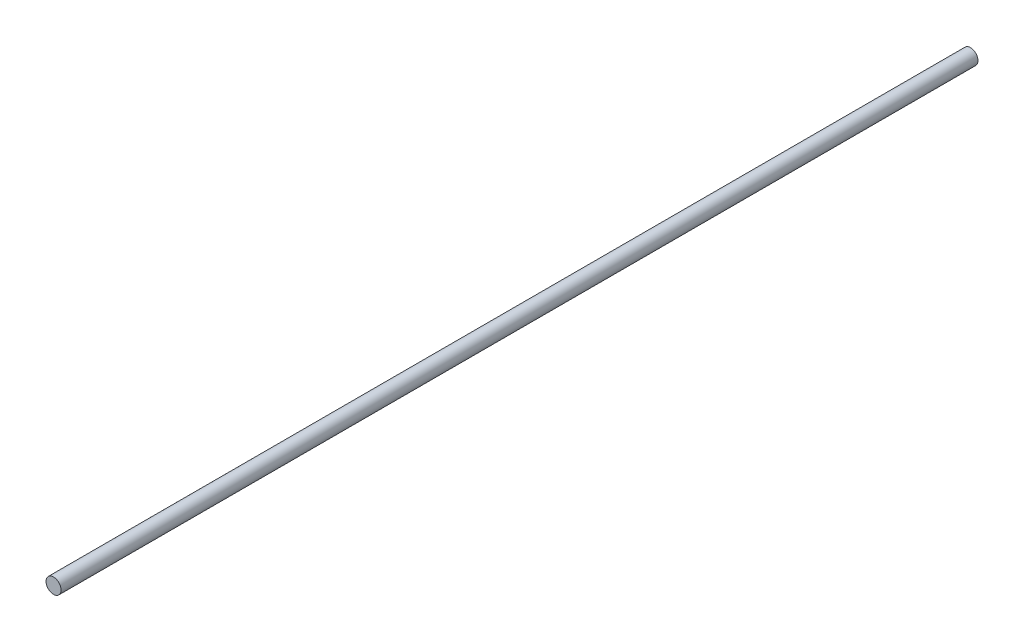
ISO-10303-21;
HEADER;
FILE_DESCRIPTION(('STEP AP214'),'2;1');
FILE_NAME('part.step','',(''),(''),'','','');
FILE_SCHEMA(('AUTOMOTIVE_DESIGN { 1 0 10303 214 1 1 1 1 }'));
ENDSEC;
DATA;
#1=APPLICATION_CONTEXT('core data for automotive mechanical design processes');
#2=APPLICATION_PROTOCOL_DEFINITION('international standard','automotive_design',2000,#1);
#3=PRODUCT_CONTEXT('',#1,'mechanical');
#4=PRODUCT('Part','Part','',(#3));
#5=PRODUCT_RELATED_PRODUCT_CATEGORY('part','',(#4));
#6=PRODUCT_DEFINITION_FORMATION('','',#4);
#7=PRODUCT_DEFINITION_CONTEXT('part definition',#1,'design');
#8=PRODUCT_DEFINITION('design','',#6,#7);
#9=PRODUCT_DEFINITION_SHAPE('','',#8);
#10=(LENGTH_UNIT() NAMED_UNIT(*) SI_UNIT(.MILLI.,.METRE.));
#11=(NAMED_UNIT(*) PLANE_ANGLE_UNIT() SI_UNIT($,.RADIAN.));
#12=(NAMED_UNIT(*) SI_UNIT($,.STERADIAN.) SOLID_ANGLE_UNIT());
#13=UNCERTAINTY_MEASURE_WITH_UNIT(LENGTH_MEASURE(1.E-05),#10,'distance_accuracy_value','');
#14=(GEOMETRIC_REPRESENTATION_CONTEXT(3) GLOBAL_UNCERTAINTY_ASSIGNED_CONTEXT((#13)) GLOBAL_UNIT_ASSIGNED_CONTEXT((#10,
#11,#12)) REPRESENTATION_CONTEXT('',''));
#15=CARTESIAN_POINT('',(0.,0.,0.));
#16=DIRECTION('',(0.,0.,1.));
#17=DIRECTION('',(1.,0.,0.));
#18=AXIS2_PLACEMENT_3D('',#15,#16,#17);
#19=CARTESIAN_POINT('',(0.,0.,-3650.));
#20=DIRECTION('',(0.,0.,1.));
#21=DIRECTION('',(1.,0.,0.));
#22=AXIS2_PLACEMENT_3D('',#19,#20,#21);
#23=CYLINDRICAL_SURFACE('',#22,30.);
#24=CARTESIAN_POINT('',(0.,0.,-3650.));
#25=DIRECTION('',(0.,0.,1.));
#26=DIRECTION('',(1.,0.,0.));
#27=AXIS2_PLACEMENT_3D('',#24,#25,#26);
#28=CIRCLE('',#27,30.);
#29=CARTESIAN_POINT('',(30.,0.,-3650.));
#30=VERTEX_POINT('',#29);
#31=EDGE_CURVE('E10',#30,#30,#28,.T.);
#32=CARTESIAN_POINT('',(0.,0.,0.));
#33=DIRECTION('',(0.,0.,1.));
#34=DIRECTION('',(1.,0.,0.));
#35=AXIS2_PLACEMENT_3D('',#32,#33,#34);
#36=CIRCLE('',#35,30.);
#37=CARTESIAN_POINT('',(30.,0.,0.));
#38=VERTEX_POINT('',#37);
#39=EDGE_CURVE('E40',#38,#38,#36,.T.);
#40=CARTESIAN_POINT('',(30.,0.,-3650.));
#41=CARTESIAN_POINT('',(30.,0.,-3611.97916666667));
#42=CARTESIAN_POINT('',(30.,0.,-3573.95833333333));
#43=CARTESIAN_POINT('',(30.,0.,-3497.91666666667));
#44=CARTESIAN_POINT('',(30.,0.,-3459.89583333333));
#45=CARTESIAN_POINT('',(30.,0.,-3383.85416666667));
#46=CARTESIAN_POINT('',(30.,0.,-3345.83333333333));
#47=CARTESIAN_POINT('',(30.,0.,-3269.79166666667));
#48=CARTESIAN_POINT('',(30.,0.,-3231.77083333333));
#49=CARTESIAN_POINT('',(30.,0.,-3155.72916666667));
#50=CARTESIAN_POINT('',(30.,0.,-3117.70833333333));
#51=CARTESIAN_POINT('',(30.,0.,-3041.66666666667));
#52=CARTESIAN_POINT('',(30.,0.,-3003.64583333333));
#53=CARTESIAN_POINT('',(30.,0.,-2927.60416666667));
#54=CARTESIAN_POINT('',(30.,0.,-2889.58333333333));
#55=CARTESIAN_POINT('',(30.,0.,-2813.54166666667));
#56=CARTESIAN_POINT('',(30.,0.,-2775.52083333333));
#57=CARTESIAN_POINT('',(30.,0.,-2699.47916666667));
#58=CARTESIAN_POINT('',(30.,0.,-2661.45833333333));
#59=CARTESIAN_POINT('',(30.,0.,-2585.41666666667));
#60=CARTESIAN_POINT('',(30.,0.,-2547.39583333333));
#61=CARTESIAN_POINT('',(30.,0.,-2471.35416666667));
#62=CARTESIAN_POINT('',(30.,0.,-2433.33333333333));
#63=CARTESIAN_POINT('',(30.,0.,-2357.29166666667));
#64=CARTESIAN_POINT('',(30.,0.,-2319.27083333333));
#65=CARTESIAN_POINT('',(30.,0.,-2243.22916666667));
#66=CARTESIAN_POINT('',(30.,0.,-2205.20833333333));
#67=CARTESIAN_POINT('',(30.,0.,-2129.16666666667));
#68=CARTESIAN_POINT('',(30.,0.,-2091.14583333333));
#69=CARTESIAN_POINT('',(30.,0.,-2015.10416666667));
#70=CARTESIAN_POINT('',(30.,0.,-1977.08333333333));
#71=CARTESIAN_POINT('',(30.,0.,-1901.04166666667));
#72=CARTESIAN_POINT('',(30.,0.,-1863.02083333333));
#73=CARTESIAN_POINT('',(30.,0.,-1786.97916666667));
#74=CARTESIAN_POINT('',(30.,0.,-1748.95833333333));
#75=CARTESIAN_POINT('',(30.,0.,-1672.91666666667));
#76=CARTESIAN_POINT('',(30.,0.,-1634.89583333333));
#77=CARTESIAN_POINT('',(30.,0.,-1558.85416666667));
#78=CARTESIAN_POINT('',(30.,0.,-1520.83333333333));
#79=CARTESIAN_POINT('',(30.,0.,-1444.79166666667));
#80=CARTESIAN_POINT('',(30.,0.,-1406.77083333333));
#81=CARTESIAN_POINT('',(30.,0.,-1330.72916666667));
#82=CARTESIAN_POINT('',(30.,0.,-1292.70833333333));
#83=CARTESIAN_POINT('',(30.,0.,-1216.66666666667));
#84=CARTESIAN_POINT('',(30.,0.,-1178.64583333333));
#85=CARTESIAN_POINT('',(30.,0.,-1102.60416666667));
#86=CARTESIAN_POINT('',(30.,0.,-1064.58333333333));
#87=CARTESIAN_POINT('',(30.,0.,-988.541666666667));
#88=CARTESIAN_POINT('',(30.,0.,-950.520833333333));
#89=CARTESIAN_POINT('',(30.,0.,-874.479166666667));
#90=CARTESIAN_POINT('',(30.,0.,-836.458333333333));
#91=CARTESIAN_POINT('',(30.,0.,-760.416666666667));
#92=CARTESIAN_POINT('',(30.,0.,-722.395833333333));
#93=CARTESIAN_POINT('',(30.,0.,-646.354166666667));
#94=CARTESIAN_POINT('',(30.,0.,-608.333333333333));
#95=CARTESIAN_POINT('',(30.,0.,-532.291666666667));
#96=CARTESIAN_POINT('',(30.,0.,-494.270833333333));
#97=CARTESIAN_POINT('',(30.,0.,-418.229166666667));
#98=CARTESIAN_POINT('',(30.,0.,-380.208333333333));
#99=CARTESIAN_POINT('',(30.,0.,-304.166666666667));
#100=CARTESIAN_POINT('',(30.,0.,-266.145833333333));
#101=CARTESIAN_POINT('',(30.,0.,-190.104166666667));
#102=CARTESIAN_POINT('',(30.,0.,-152.083333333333));
#103=CARTESIAN_POINT('',(30.,0.,-76.0416666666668));
#104=CARTESIAN_POINT('',(30.,0.,-38.0208333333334));
#105=CARTESIAN_POINT('',(30.,0.,0.));
#106=B_SPLINE_CURVE_WITH_KNOTS('',3,(#40,#41,#42,#43,#44,#45,#46,#47,#48,#49,#50,#51,#52,#53,
#54,#55,#56,#57,#58,#59,#60,#61,#62,#63,#64,#65,#66,#67,#68,#69,#70,#71,#72,#73,#74,#75,#76,#77,
#78,#79,#80,#81,#82,#83,#84,#85,#86,#87,#88,#89,#90,#91,#92,#93,#94,#95,#96,#97,#98,#99,#100,
#101,#102,#103,#104,#105),.UNSPECIFIED.,.F.,.F.,(4,2,2,2,2,2,2,2,2,2,2,2,2,2,2,2,2,2,2,2,2,2,2,
2,2,2,2,2,2,2,2,2,4),(0.,114.0625,228.125,342.1875,456.25,570.3125,684.375,798.4375,912.5,
1026.5625,1140.625,1254.6875,1368.75,1482.8125,1596.875,1710.9375,1825.,1939.0625,2053.125,
2167.1875,2281.25,2395.3125,2509.375,2623.4375,2737.5,2851.5625,2965.625,3079.6875,3193.75,
3307.8125,3421.875,3535.9375,3650.),.UNSPECIFIED.);
#107=EDGE_CURVE('BSEAM37',#30,#38,#106,.T.);
#108=ORIENTED_EDGE('',*,*,#31,.T.);
#109=ORIENTED_EDGE('',*,*,#39,.F.);
#110=ORIENTED_EDGE('',*,*,#107,.T.);
#111=ORIENTED_EDGE('',*,*,#107,.F.);
#112=EDGE_LOOP('',(#108,#110,#109,#111));
#113=FACE_BOUND('',#112,.T.);
#114=ADVANCED_FACE('F37',(#113),#23,.T.);
#115=CARTESIAN_POINT('',(0.,0.,-3650.));
#116=DIRECTION('',(0.,0.,1.));
#117=DIRECTION('',(1.,0.,0.));
#118=AXIS2_PLACEMENT_3D('',#115,#116,#117);
#119=PLANE('',#118);
#120=ORIENTED_EDGE('',*,*,#31,.F.);
#121=EDGE_LOOP('',(#120));
#122=FACE_BOUND('',#121,.T.);
#123=ADVANCED_FACE('F54',(#122),#119,.F.);
#124=CARTESIAN_POINT('',(0.,0.,0.));
#125=DIRECTION('',(0.,0.,1.));
#126=DIRECTION('',(1.,0.,0.));
#127=AXIS2_PLACEMENT_3D('',#124,#125,#126);
#128=PLANE('',#127);
#129=ORIENTED_EDGE('',*,*,#39,.T.);
#130=EDGE_LOOP('',(#129));
#131=FACE_BOUND('',#130,.T.);
#132=ADVANCED_FACE('F51',(#131),#128,.T.);
#133=CLOSED_SHELL('',(#114,#123,#132));
#134=MANIFOLD_SOLID_BREP('B2',#133);
#135=ADVANCED_BREP_SHAPE_REPRESENTATION('',(#18,#134),#14);
#136=SHAPE_DEFINITION_REPRESENTATION(#9,#135);
ENDSEC;
END-ISO-10303-21;
